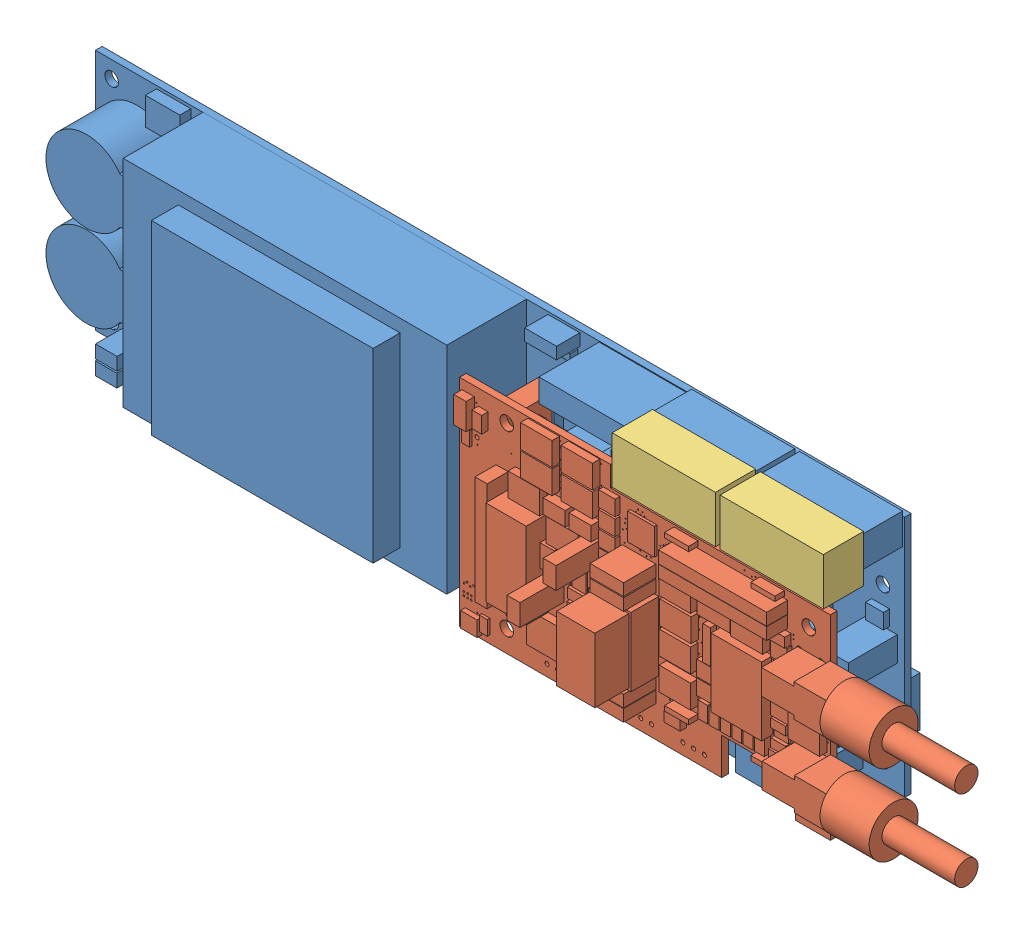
SolidWorks assembly DFlogger.SLDASM, configuration Default (file format 8000). Lengths in mm.
Overall size (226.79 58.69 44.02).
4 component instances, 3 part files, 10 mates.
Components (placement in the parent):
- 10020446rA-1: 10020446rA.SLDPRT [Default] at origin size (190.5 58.23 37.15)
- 1002055rA_1-2: 1002055rA_1.SLDPRT [Default] at (103.1875 0 17.4625) size (123.6 50.8 31.76)
- Phoenix_1843240-1: Phoenix_1843240.SLDPRT [Default] at (165.7758 58.6854 20.2874) x (1 0 0) z (0 1 0) size (24.3 9.5 11.1)
- Phoenix_1843240-2: Phoenix_1843240.SLDPRT [Default] at (140.3758 58.6854 20.2874) x (1 0 0) z (0 1 0) size (24.3 9.5 11.1)
Mates (geometry in assembly coordinates):
- Parallel2: parallel anti-aligned: plane of 10020446rA-1 through (0 0 1.5875) normal (0 0 1); plane of 1002055rA_1-2 through (103.1875 0 17.4625) normal (0 0 -1)
- Distance3: distance = 15.875 mm anti-aligned: plane of 1002055rA_1-2 through (103.1875 0 17.4625) normal (0 0 -1); plane of 10020446rA-1 through (0 0 1.5875) normal (0 0 1)
- Coincident14: coincident aligned: plane of 10020446rA-1 through (190.5 0 1.5875) normal (1 0 0); plane of 1002055rA_1-2 through (190.5 0 19.05) normal (1 0 0)
- Coincident15: coincident aligned: plane of 10020446rA-1 through (0 0 1.5875) normal (0 -1 0); plane of 1002055rA_1-2 through (103.1875 0 19.05) normal (0 -1 0)
- Coincident16: coincident anti-aligned: plane of Phoenix_1843240-1 through (165.7758 47.5854 10.7874) normal (0 0 -1); plane of ? through (190.0758 50.9854 10.7874) normal (0 0 1)
- Coincident17: coincident aligned: plane of ? through (190.0758 58.2346 10.7874) normal (1 0 0); plane of Phoenix_1843240-1 through (190.0758 58.6854 10.7874) normal (1 0 0)
- Distance4: distance = 3.4 mm aligned: plane of ? through (190.0758 50.9854 10.7874) normal (0 -1 0); plane of Phoenix_1843240-1 through (165.7758 47.5854 10.7874) normal (0 -1 0)
- Coincident19: coincident anti-aligned: plane of ? through (164.6758 50.9854 10.7874) normal (0 0 1); plane of Phoenix_1843240-2 through (140.3758 47.5854 10.7874) normal (0 0 -1)
- Coincident20: coincident aligned: plane of ? through (164.6758 58.2346 10.7874) normal (1 0 0); plane of Phoenix_1843240-2 through (164.6758 58.6854 10.7874) normal (1 0 0)
- Distance5: distance = 3.4 mm aligned: plane of Phoenix_1843240-2 through (140.3758 47.5854 10.7874) normal (0 -1 0); plane of ? through (164.6758 50.9854 10.7874) normal (0 -1 0)
